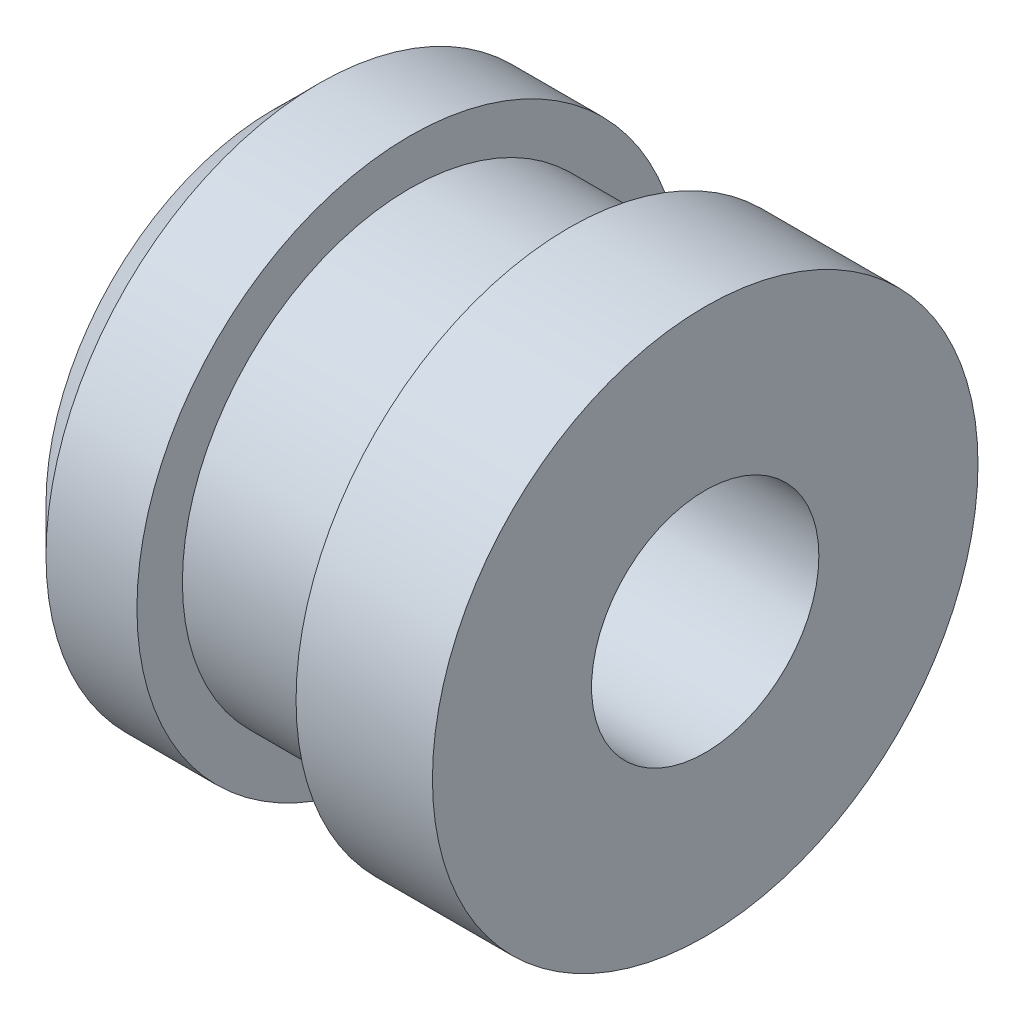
from build123d import *

# Parameters (mm, degrees)
CHAMFER1_SIZE      = 1
SKETCH2_R          = 2.5
CUT_EXTRUDE1_DEPTH = 8


with BuildPart() as part:
    # Sketch1 → Revolve1 (revolve)
    with BuildSketch(Plane(origin=(0, 0, 0), x_dir=(1, 0, 0), z_dir=(0, 1, 0)), mode=Mode.PRIVATE) as revolve1_sk:
        Polygon((0, 0), (9.5, 0), (9.5, 6), (6.5, 6), (6.5, 5), (3, 5), (3, 6), (0, 6), align=None)
    revolve(revolve1_sk.sketch.rotate(Axis((0, 0, 0), (1, 0, 0)), 180), axis=Axis((0, 0, 0), (1, 0, 0)))

    # Chamfer1
    chamfer1_edges = [part.edges().sort_by_distance(p)[0] for p in [
        (0, 0, -6),
    ]]
    chamfer(chamfer1_edges, length=CHAMFER1_SIZE)

    # Sketch2 → Cut-Extrude1 (cut)
    with BuildSketch(Plane(origin=(9.5, 0, 0), x_dir=(0, 0, -1), z_dir=(1, 0, 0))):
        Circle(SKETCH2_R)
    extrude(amount=-CUT_EXTRUDE1_DEPTH, mode=Mode.SUBTRACT)


solid = part.part
